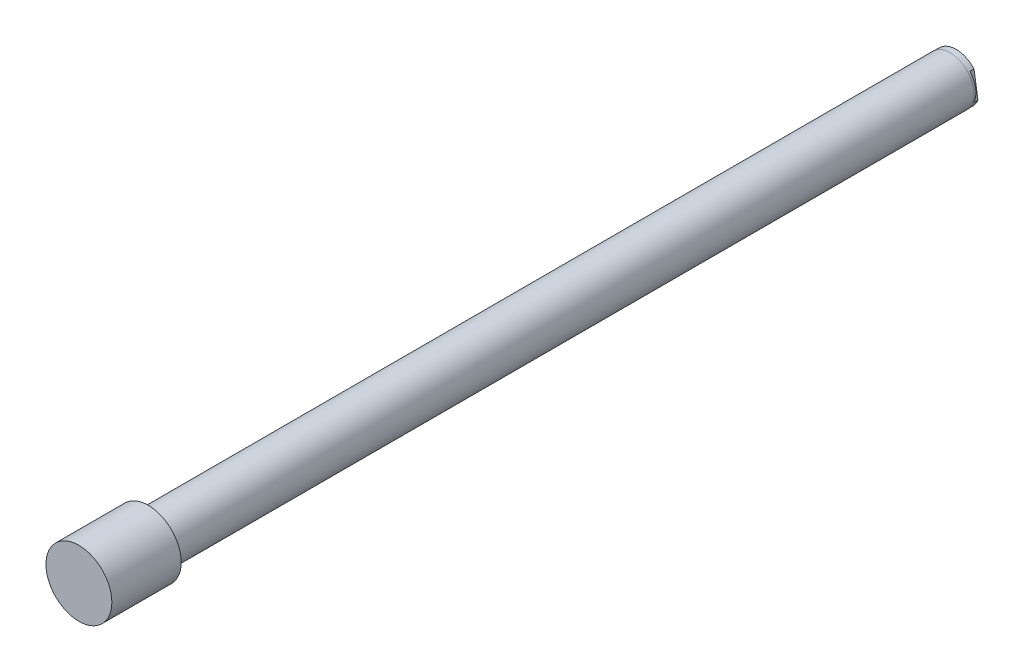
ISO-10303-21;
HEADER;
FILE_DESCRIPTION(('STEP AP214'),'2;1');
FILE_NAME('part.step','',(''),(''),'','','');
FILE_SCHEMA(('AUTOMOTIVE_DESIGN { 1 0 10303 214 1 1 1 1 }'));
ENDSEC;
DATA;
#1=APPLICATION_CONTEXT('core data for automotive mechanical design processes');
#2=APPLICATION_PROTOCOL_DEFINITION('international standard','automotive_design',2000,#1);
#3=PRODUCT_CONTEXT('',#1,'mechanical');
#4=PRODUCT('Part','Part','',(#3));
#5=PRODUCT_RELATED_PRODUCT_CATEGORY('part','',(#4));
#6=PRODUCT_DEFINITION_FORMATION('','',#4);
#7=PRODUCT_DEFINITION_CONTEXT('part definition',#1,'design');
#8=PRODUCT_DEFINITION('design','',#6,#7);
#9=PRODUCT_DEFINITION_SHAPE('','',#8);
#10=(LENGTH_UNIT() NAMED_UNIT(*) SI_UNIT(.MILLI.,.METRE.));
#11=(NAMED_UNIT(*) PLANE_ANGLE_UNIT() SI_UNIT($,.RADIAN.));
#12=(NAMED_UNIT(*) SI_UNIT($,.STERADIAN.) SOLID_ANGLE_UNIT());
#13=UNCERTAINTY_MEASURE_WITH_UNIT(LENGTH_MEASURE(1.E-05),#10,'distance_accuracy_value','');
#14=(GEOMETRIC_REPRESENTATION_CONTEXT(3) GLOBAL_UNCERTAINTY_ASSIGNED_CONTEXT((#13)) GLOBAL_UNIT_ASSIGNED_CONTEXT((#10,
#11,#12)) REPRESENTATION_CONTEXT('',''));
#15=CARTESIAN_POINT('',(0.,0.,0.));
#16=DIRECTION('',(0.,0.,1.));
#17=DIRECTION('',(1.,0.,0.));
#18=AXIS2_PLACEMENT_3D('',#15,#16,#17);
#19=CARTESIAN_POINT('',(0.,0.,29.21));
#20=DIRECTION('',(0.,0.,-1.));
#21=DIRECTION('',(0.156434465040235,-0.987688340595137,0.));
#22=AXIS2_PLACEMENT_3D('',#19,#20,#21);
#23=CONICAL_SURFACE('',#22,4.96062,1.02974425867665);
#24=CARTESIAN_POINT('',(0.,0.,32.1906412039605));
#25=VERTEX_POINT('',#24);
#26=VERTEX_LOOP('',#25);
#27=FACE_BOUND('',#26,.T.);
#28=CARTESIAN_POINT('',(0.,0.,29.21));
#29=DIRECTION('',(0.,0.,-1.));
#30=DIRECTION('',(0.156434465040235,-0.987688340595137,0.));
#31=AXIS2_PLACEMENT_3D('',#28,#29,#30);
#32=CIRCLE('',#31,4.96062);
#33=CARTESIAN_POINT('',(0.776011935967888,-4.89954653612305,29.21));
#34=VERTEX_POINT('',#33);
#35=EDGE_CURVE('E68',#34,#34,#32,.T.);
#36=ORIENTED_EDGE('',*,*,#35,.T.);
#37=EDGE_LOOP('',(#36));
#38=FACE_BOUND('',#37,.T.);
#39=ADVANCED_FACE('F16',(#27,#38),#23,.F.);
#40=CARTESIAN_POINT('',(0.,0.,2.54));
#41=DIRECTION('',(0.,0.,-1.));
#42=DIRECTION('',(0.156434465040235,-0.987688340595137,0.));
#43=AXIS2_PLACEMENT_3D('',#40,#41,#42);
#44=PLANE('',#43);
#45=DIRECTION('',(0.156434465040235,-0.987688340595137,0.));
#46=VECTOR('',#45,1.);
#47=CARTESIAN_POINT('',(11.1719712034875,9.83526424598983,2.54));
#48=LINE('',#47,#46);
#49=CARTESIAN_POINT('',(11.1719712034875,9.83526424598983,2.54));
#50=VERTEX_POINT('',#49);
#51=CARTESIAN_POINT('',(13.6644398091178,-5.90156318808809,2.54));
#52=VERTEX_POINT('',#51);
#53=EDGE_CURVE('E78',#50,#52,#48,.T.);
#54=ORIENTED_EDGE('',*,*,#53,.F.);
#55=CARTESIAN_POINT('',(0.,0.,2.54));
#56=DIRECTION('',(0.,0.,-1.));
#57=DIRECTION('',(0.156434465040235,-0.987688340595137,0.));
#58=AXIS2_PLACEMENT_3D('',#55,#56,#57);
#59=CIRCLE('',#58,14.8844);
#60=EDGE_CURVE('E10',#52,#50,#59,.F.);
#61=ORIENTED_EDGE('',*,*,#60,.F.);
#62=EDGE_LOOP('',(#54,#61));
#63=FACE_BOUND('',#62,.T.);
#64=ADVANCED_FACE('F64',(#63),#44,.T.);
#65=CARTESIAN_POINT('',(11.1719712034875,9.83526424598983,2.54));
#66=DIRECTION('',(0.987688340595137,0.156434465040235,0.));
#67=DIRECTION('',(0.,0.,1.));
#68=AXIS2_PLACEMENT_3D('',#65,#66,#67);
#69=PLANE('',#68);
#70=DIRECTION('',(0.156434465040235,-0.987688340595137,0.));
#71=VECTOR('',#70,1.);
#72=CARTESIAN_POINT('',(11.1719712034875,9.83526424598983,0.));
#73=LINE('',#72,#71);
#74=CARTESIAN_POINT('',(11.1719712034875,9.83526424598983,0.));
#75=VERTEX_POINT('',#74);
#76=CARTESIAN_POINT('',(13.6644398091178,-5.90156318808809,0.));
#77=VERTEX_POINT('',#76);
#78=EDGE_CURVE('E73',#75,#77,#73,.T.);
#79=ORIENTED_EDGE('',*,*,#78,.F.);
#80=DIRECTION('',(0.,0.,-1.));
#81=VECTOR('',#80,1.);
#82=CARTESIAN_POINT('',(11.1719712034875,9.83526424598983,2.54));
#83=LINE('',#82,#81);
#84=EDGE_CURVE('E83',#50,#75,#83,.T.);
#85=ORIENTED_EDGE('',*,*,#84,.F.);
#86=ORIENTED_EDGE('',*,*,#53,.T.);
#87=DIRECTION('',(0.,0.,-1.));
#88=VECTOR('',#87,1.);
#89=CARTESIAN_POINT('',(13.6644398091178,-5.90156318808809,2.54));
#90=LINE('',#89,#88);
#91=EDGE_CURVE('E33',#52,#77,#90,.T.);
#92=ORIENTED_EDGE('',*,*,#91,.T.);
#93=EDGE_LOOP('',(#79,#85,#86,#92));
#94=FACE_BOUND('',#93,.T.);
#95=ADVANCED_FACE('F161',(#94),#69,.T.);
#96=DIRECTION('',(-0.156434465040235,0.987688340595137,0.));
#97=VECTOR('',#96,1.);
#98=CARTESIAN_POINT('',(-13.6644398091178,5.90156318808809,2.54));
#99=LINE('',#98,#97);
#100=CARTESIAN_POINT('',(-11.1719712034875,-9.83526424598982,2.54));
#101=VERTEX_POINT('',#100);
#102=CARTESIAN_POINT('',(-13.6644398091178,5.90156318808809,2.54));
#103=VERTEX_POINT('',#102);
#104=EDGE_CURVE('E80',#101,#103,#99,.T.);
#105=ORIENTED_EDGE('',*,*,#104,.F.);
#106=EDGE_CURVE('E25',#103,#101,#59,.F.);
#107=ORIENTED_EDGE('',*,*,#106,.F.);
#108=EDGE_LOOP('',(#105,#107));
#109=FACE_BOUND('',#108,.T.);
#110=ADVANCED_FACE('F158',(#109),#44,.T.);
#111=CARTESIAN_POINT('',(-13.6644398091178,5.90156318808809,2.54));
#112=DIRECTION('',(-0.987688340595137,-0.156434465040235,0.));
#113=DIRECTION('',(0.,0.,-1.));
#114=AXIS2_PLACEMENT_3D('',#111,#112,#113);
#115=PLANE('',#114);
#116=DIRECTION('',(-0.156434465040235,0.987688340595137,0.));
#117=VECTOR('',#116,1.);
#118=CARTESIAN_POINT('',(-13.6644398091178,5.90156318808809,0.));
#119=LINE('',#118,#117);
#120=CARTESIAN_POINT('',(-11.1719712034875,-9.83526424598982,0.));
#121=VERTEX_POINT('',#120);
#122=CARTESIAN_POINT('',(-13.6644398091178,5.90156318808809,0.));
#123=VERTEX_POINT('',#122);
#124=EDGE_CURVE('E81',#121,#123,#119,.T.);
#125=ORIENTED_EDGE('',*,*,#124,.F.);
#126=DIRECTION('',(0.,0.,-1.));
#127=VECTOR('',#126,1.);
#128=CARTESIAN_POINT('',(-11.1719712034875,-9.83526424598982,2.54));
#129=LINE('',#128,#127);
#130=EDGE_CURVE('E88',#101,#121,#129,.T.);
#131=ORIENTED_EDGE('',*,*,#130,.F.);
#132=ORIENTED_EDGE('',*,*,#104,.T.);
#133=DIRECTION('',(0.,0.,-1.));
#134=VECTOR('',#133,1.);
#135=CARTESIAN_POINT('',(-13.6644398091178,5.90156318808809,2.54));
#136=LINE('',#135,#134);
#137=EDGE_CURVE('E41',#103,#123,#136,.T.);
#138=ORIENTED_EDGE('',*,*,#137,.T.);
#139=EDGE_LOOP('',(#125,#131,#132,#138));
#140=FACE_BOUND('',#139,.T.);
#141=ADVANCED_FACE('F156',(#140),#115,.T.);
#142=CARTESIAN_POINT('',(0.,0.,0.));
#143=DIRECTION('',(0.,0.,-1.));
#144=DIRECTION('',(0.156434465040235,-0.987688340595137,0.));
#145=AXIS2_PLACEMENT_3D('',#142,#143,#144);
#146=PLANE('',#145);
#147=CARTESIAN_POINT('',(0.,0.,0.));
#148=DIRECTION('',(0.,0.,-1.));
#149=DIRECTION('',(0.156434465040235,-0.987688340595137,0.));
#150=AXIS2_PLACEMENT_3D('',#147,#148,#149);
#151=CIRCLE('',#150,4.96062);
#152=CARTESIAN_POINT('',(0.776011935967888,-4.89954653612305,0.));
#153=VERTEX_POINT('',#152);
#154=EDGE_CURVE('E70',#153,#153,#151,.T.);
#155=ORIENTED_EDGE('',*,*,#154,.F.);
#156=EDGE_LOOP('',(#155));
#157=FACE_BOUND('',#156,.T.);
#158=CARTESIAN_POINT('',(0.,0.,0.));
#159=DIRECTION('',(0.,0.,-1.));
#160=DIRECTION('',(0.156434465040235,-0.987688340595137,0.));
#161=AXIS2_PLACEMENT_3D('',#158,#159,#160);
#162=CIRCLE('',#161,14.8844);
#163=EDGE_CURVE('E96',#77,#121,#162,.T.);
#164=ORIENTED_EDGE('',*,*,#163,.T.);
#165=ORIENTED_EDGE('',*,*,#124,.T.);
#166=EDGE_CURVE('E98',#123,#75,#162,.T.);
#167=ORIENTED_EDGE('',*,*,#166,.T.);
#168=ORIENTED_EDGE('',*,*,#78,.T.);
#169=EDGE_LOOP('',(#164,#165,#167,#168));
#170=FACE_BOUND('',#169,.T.);
#171=ADVANCED_FACE('F149',(#157,#170),#146,.T.);
#172=CARTESIAN_POINT('',(0.,0.,0.));
#173=DIRECTION('',(0.,0.,-1.));
#174=DIRECTION('',(0.156434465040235,-0.987688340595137,0.));
#175=AXIS2_PLACEMENT_3D('',#172,#173,#174);
#176=CYLINDRICAL_SURFACE('',#175,4.96062);
#177=ORIENTED_EDGE('',*,*,#154,.T.);
#178=EDGE_LOOP('',(#177));
#179=FACE_BOUND('',#178,.T.);
#180=ORIENTED_EDGE('',*,*,#35,.F.);
#181=EDGE_LOOP('',(#180));
#182=FACE_BOUND('',#181,.T.);
#183=ADVANCED_FACE('F142',(#179,#182),#176,.F.);
#184=CARTESIAN_POINT('',(0.,0.,2.54));
#185=DIRECTION('',(0.,0.,-1.));
#186=DIRECTION('',(0.156434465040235,-0.987688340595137,0.));
#187=AXIS2_PLACEMENT_3D('',#184,#185,#186);
#188=CYLINDRICAL_SURFACE('',#187,14.8844);
#189=ORIENTED_EDGE('',*,*,#166,.F.);
#190=ORIENTED_EDGE('',*,*,#137,.F.);
#191=ORIENTED_EDGE('',*,*,#106,.T.);
#192=ORIENTED_EDGE('',*,*,#130,.T.);
#193=ORIENTED_EDGE('',*,*,#163,.F.);
#194=ORIENTED_EDGE('',*,*,#91,.F.);
#195=ORIENTED_EDGE('',*,*,#60,.T.);
#196=ORIENTED_EDGE('',*,*,#84,.T.);
#197=EDGE_LOOP('',(#189,#190,#191,#192,#193,#194,#195,#196));
#198=FACE_BOUND('',#197,.T.);
#199=CARTESIAN_POINT('',(0.,0.,3.81));
#200=DIRECTION('',(0.,0.,1.));
#201=DIRECTION('',(-0.156434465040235,0.987688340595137,0.));
#202=AXIS2_PLACEMENT_3D('',#199,#200,#201);
#203=CIRCLE('',#202,14.8844);
#204=CARTESIAN_POINT('',(-2.32843315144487,14.7011483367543,3.81));
#205=VERTEX_POINT('',#204);
#206=EDGE_CURVE('E87',#205,#205,#203,.T.);
#207=ORIENTED_EDGE('',*,*,#206,.F.);
#208=EDGE_LOOP('',(#207));
#209=FACE_BOUND('',#208,.T.);
#210=ADVANCED_FACE('F126',(#198,#209),#188,.T.);
#211=CARTESIAN_POINT('',(0.,0.,549.402));
#212=DIRECTION('',(0.,0.,1.));
#213=DIRECTION('',(1.,0.,0.));
#214=AXIS2_PLACEMENT_3D('',#211,#212,#213);
#215=PLANE('',#214);
#216=CARTESIAN_POINT('',(0.,0.,549.402));
#217=DIRECTION('',(0.,0.,1.));
#218=DIRECTION('',(1.,0.,0.));
#219=AXIS2_PLACEMENT_3D('',#216,#217,#218);
#220=CIRCLE('',#219,20.6375);
#221=CARTESIAN_POINT('',(20.6375,0.,549.402));
#222=VERTEX_POINT('',#221);
#223=EDGE_CURVE('E100',#222,#222,#220,.T.);
#224=ORIENTED_EDGE('',*,*,#223,.T.);
#225=EDGE_LOOP('',(#224));
#226=FACE_BOUND('',#225,.T.);
#227=ADVANCED_FACE('F118',(#226),#215,.T.);
#228=CARTESIAN_POINT('',(0.,0.,549.402));
#229=DIRECTION('',(0.,0.,-1.));
#230=DIRECTION('',(-1.,0.,0.));
#231=AXIS2_PLACEMENT_3D('',#228,#229,#230);
#232=CYLINDRICAL_SURFACE('',#231,20.6375);
#233=ORIENTED_EDGE('',*,*,#223,.F.);
#234=EDGE_LOOP('',(#233));
#235=FACE_BOUND('',#234,.T.);
#236=CARTESIAN_POINT('',(0.,0.,505.968));
#237=DIRECTION('',(0.,0.,1.));
#238=DIRECTION('',(1.,0.,0.));
#239=AXIS2_PLACEMENT_3D('',#236,#237,#238);
#240=CIRCLE('',#239,20.6375);
#241=CARTESIAN_POINT('',(20.6375,0.,505.968));
#242=VERTEX_POINT('',#241);
#243=EDGE_CURVE('E103',#242,#242,#240,.T.);
#244=ORIENTED_EDGE('',*,*,#243,.T.);
#245=EDGE_LOOP('',(#244));
#246=FACE_BOUND('',#245,.T.);
#247=ADVANCED_FACE('F112',(#235,#246),#232,.T.);
#248=CARTESIAN_POINT('',(0.,0.,505.968));
#249=DIRECTION('',(0.,0.,1.));
#250=DIRECTION('',(1.,0.,0.));
#251=AXIS2_PLACEMENT_3D('',#248,#249,#250);
#252=PLANE('',#251);
#253=CARTESIAN_POINT('',(0.,0.,505.968));
#254=DIRECTION('',(0.,0.,1.));
#255=DIRECTION('',(1.,0.,0.));
#256=AXIS2_PLACEMENT_3D('',#253,#254,#255);
#257=CIRCLE('',#256,14.9987);
#258=CARTESIAN_POINT('',(14.9987,0.,505.968));
#259=VERTEX_POINT('',#258);
#260=EDGE_CURVE('E76',#259,#259,#257,.F.);
#261=ORIENTED_EDGE('',*,*,#260,.F.);
#262=EDGE_LOOP('',(#261));
#263=FACE_BOUND('',#262,.T.);
#264=ORIENTED_EDGE('',*,*,#243,.F.);
#265=EDGE_LOOP('',(#264));
#266=FACE_BOUND('',#265,.T.);
#267=ADVANCED_FACE('F109',(#263,#266),#252,.F.);
#268=CARTESIAN_POINT('',(0.,0.,505.968));
#269=DIRECTION('',(0.,0.,-1.));
#270=DIRECTION('',(-1.,0.,0.));
#271=AXIS2_PLACEMENT_3D('',#268,#269,#270);
#272=CYLINDRICAL_SURFACE('',#271,14.9987);
#273=CARTESIAN_POINT('',(0.,0.,3.81));
#274=DIRECTION('',(0.,0.,-1.));
#275=DIRECTION('',(-1.,0.,0.));
#276=AXIS2_PLACEMENT_3D('',#273,#274,#275);
#277=CIRCLE('',#276,14.9987);
#278=CARTESIAN_POINT('',(-14.9987,0.,3.81));
#279=VERTEX_POINT('',#278);
#280=EDGE_CURVE('E20',#279,#279,#277,.T.);
#281=ORIENTED_EDGE('',*,*,#280,.F.);
#282=EDGE_LOOP('',(#281));
#283=FACE_BOUND('',#282,.T.);
#284=ORIENTED_EDGE('',*,*,#260,.T.);
#285=EDGE_LOOP('',(#284));
#286=FACE_BOUND('',#285,.T.);
#287=ADVANCED_FACE('F18',(#283,#286),#272,.T.);
#288=CARTESIAN_POINT('',(0.,0.,3.81));
#289=DIRECTION('',(0.,0.,-1.));
#290=DIRECTION('',(-1.,0.,0.));
#291=AXIS2_PLACEMENT_3D('',#288,#289,#290);
#292=PLANE('',#291);
#293=ORIENTED_EDGE('',*,*,#206,.T.);
#294=EDGE_LOOP('',(#293));
#295=FACE_BOUND('',#294,.T.);
#296=ORIENTED_EDGE('',*,*,#280,.T.);
#297=EDGE_LOOP('',(#296));
#298=FACE_BOUND('',#297,.T.);
#299=ADVANCED_FACE('F114',(#295,#298),#292,.T.);
#300=CLOSED_SHELL('',(#39,#64,#95,#110,#141,#171,#183,#210,#227,#247,#267,#287,#299));
#301=MANIFOLD_SOLID_BREP('B1',#300);
#302=ADVANCED_BREP_SHAPE_REPRESENTATION('',(#18,#301),#14);
#303=SHAPE_DEFINITION_REPRESENTATION(#9,#302);
ENDSEC;
END-ISO-10303-21;
